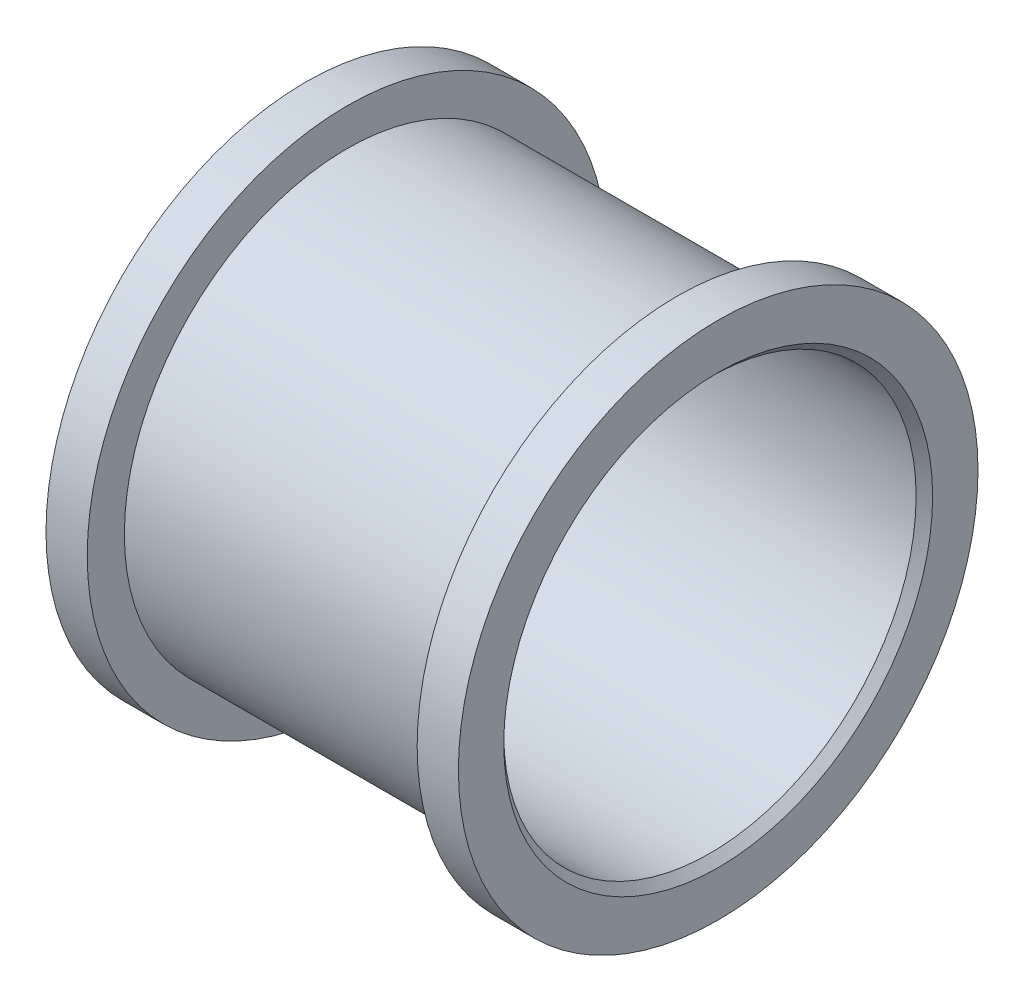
ISO-10303-21;
HEADER;
FILE_DESCRIPTION(('STEP AP214'),'2;1');
FILE_NAME('part.step','',(''),(''),'','','');
FILE_SCHEMA(('AUTOMOTIVE_DESIGN { 1 0 10303 214 1 1 1 1 }'));
ENDSEC;
DATA;
#1=APPLICATION_CONTEXT('core data for automotive mechanical design processes');
#2=APPLICATION_PROTOCOL_DEFINITION('international standard','automotive_design',2000,#1);
#3=PRODUCT_CONTEXT('',#1,'mechanical');
#4=PRODUCT('Part','Part','',(#3));
#5=PRODUCT_RELATED_PRODUCT_CATEGORY('part','',(#4));
#6=PRODUCT_DEFINITION_FORMATION('','',#4);
#7=PRODUCT_DEFINITION_CONTEXT('part definition',#1,'design');
#8=PRODUCT_DEFINITION('design','',#6,#7);
#9=PRODUCT_DEFINITION_SHAPE('','',#8);
#10=(LENGTH_UNIT() NAMED_UNIT(*) SI_UNIT(.MILLI.,.METRE.));
#11=(NAMED_UNIT(*) PLANE_ANGLE_UNIT() SI_UNIT($,.RADIAN.));
#12=(NAMED_UNIT(*) SI_UNIT($,.STERADIAN.) SOLID_ANGLE_UNIT());
#13=UNCERTAINTY_MEASURE_WITH_UNIT(LENGTH_MEASURE(1.E-05),#10,'distance_accuracy_value','');
#14=(GEOMETRIC_REPRESENTATION_CONTEXT(3) GLOBAL_UNCERTAINTY_ASSIGNED_CONTEXT((#13)) GLOBAL_UNIT_ASSIGNED_CONTEXT((#10,
#11,#12)) REPRESENTATION_CONTEXT('',''));
#15=CARTESIAN_POINT('',(0.,0.,0.));
#16=DIRECTION('',(0.,0.,1.));
#17=DIRECTION('',(1.,0.,0.));
#18=AXIS2_PLACEMENT_3D('',#15,#16,#17);
#19=CARTESIAN_POINT('',(0.,2.5,0.));
#20=DIRECTION('',(1.,0.,0.));
#21=DIRECTION('',(0.,0.,-1.));
#22=AXIS2_PLACEMENT_3D('',#19,#20,#21);
#23=PLANE('',#22);
#24=CARTESIAN_POINT('',(0.,0.,0.));
#25=DIRECTION('',(1.,0.,0.));
#26=DIRECTION('',(0.,0.,-1.));
#27=AXIS2_PLACEMENT_3D('',#24,#25,#26);
#28=CIRCLE('',#27,2.6);
#29=CARTESIAN_POINT('',(0.,0.,-2.6));
#30=VERTEX_POINT('',#29);
#31=EDGE_CURVE('E356',#30,#30,#28,.T.);
#32=ORIENTED_EDGE('',*,*,#31,.T.);
#33=EDGE_LOOP('',(#32));
#34=FACE_BOUND('',#33,.T.);
#35=CARTESIAN_POINT('',(0.,0.,0.));
#36=DIRECTION('',(-1.,0.,0.));
#37=DIRECTION('',(0.,0.,1.));
#38=AXIS2_PLACEMENT_3D('',#35,#36,#37);
#39=CIRCLE('',#38,3.15);
#40=CARTESIAN_POINT('',(0.,0.,3.15));
#41=VERTEX_POINT('',#40);
#42=EDGE_CURVE('E369',#41,#41,#39,.T.);
#43=ORIENTED_EDGE('',*,*,#42,.T.);
#44=EDGE_LOOP('',(#43));
#45=FACE_BOUND('',#44,.T.);
#46=ADVANCED_FACE('F350',(#34,#45),#23,.F.);
#47=CARTESIAN_POINT('',(-47.6496124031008,0.,0.));
#48=DIRECTION('',(-1.,0.,0.));
#49=DIRECTION('',(0.,0.,1.));
#50=AXIS2_PLACEMENT_3D('',#47,#48,#49);
#51=CYLINDRICAL_SURFACE('',#50,3.15);
#52=ORIENTED_EDGE('',*,*,#42,.F.);
#53=EDGE_LOOP('',(#52));
#54=FACE_BOUND('',#53,.T.);
#55=CARTESIAN_POINT('',(0.5,0.,0.));
#56=DIRECTION('',(-1.,0.,0.));
#57=DIRECTION('',(0.,0.,1.));
#58=AXIS2_PLACEMENT_3D('',#55,#56,#57);
#59=CIRCLE('',#58,3.15);
#60=CARTESIAN_POINT('',(0.5,0.,3.15));
#61=VERTEX_POINT('',#60);
#62=EDGE_CURVE('E372',#61,#61,#59,.T.);
#63=ORIENTED_EDGE('',*,*,#62,.T.);
#64=EDGE_LOOP('',(#63));
#65=FACE_BOUND('',#64,.T.);
#66=ADVANCED_FACE('F405',(#54,#65),#51,.T.);
#67=CARTESIAN_POINT('',(0.5,3.15,0.));
#68=DIRECTION('',(-1.,0.,0.));
#69=DIRECTION('',(0.,0.,1.));
#70=AXIS2_PLACEMENT_3D('',#67,#68,#69);
#71=PLANE('',#70);
#72=ORIENTED_EDGE('',*,*,#62,.F.);
#73=EDGE_LOOP('',(#72));
#74=FACE_BOUND('',#73,.T.);
#75=CARTESIAN_POINT('',(0.5,0.,0.));
#76=DIRECTION('',(-1.,0.,0.));
#77=DIRECTION('',(0.,0.,1.));
#78=AXIS2_PLACEMENT_3D('',#75,#76,#77);
#79=CIRCLE('',#78,2.7);
#80=CARTESIAN_POINT('',(0.5,0.,2.7));
#81=VERTEX_POINT('',#80);
#82=EDGE_CURVE('E375',#81,#81,#79,.T.);
#83=ORIENTED_EDGE('',*,*,#82,.T.);
#84=EDGE_LOOP('',(#83));
#85=FACE_BOUND('',#84,.T.);
#86=ADVANCED_FACE('F409',(#74,#85),#71,.F.);
#87=CARTESIAN_POINT('',(-47.6496124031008,0.,0.));
#88=DIRECTION('',(-1.,0.,0.));
#89=DIRECTION('',(0.,0.,1.));
#90=AXIS2_PLACEMENT_3D('',#87,#88,#89);
#91=CYLINDRICAL_SURFACE('',#90,2.7);
#92=ORIENTED_EDGE('',*,*,#82,.F.);
#93=EDGE_LOOP('',(#92));
#94=FACE_BOUND('',#93,.T.);
#95=CARTESIAN_POINT('',(4.5,0.,0.));
#96=DIRECTION('',(-1.,0.,0.));
#97=DIRECTION('',(0.,0.,1.));
#98=AXIS2_PLACEMENT_3D('',#95,#96,#97);
#99=CIRCLE('',#98,2.7);
#100=CARTESIAN_POINT('',(4.5,0.,2.7));
#101=VERTEX_POINT('',#100);
#102=EDGE_CURVE('E378',#101,#101,#99,.T.);
#103=ORIENTED_EDGE('',*,*,#102,.T.);
#104=EDGE_LOOP('',(#103));
#105=FACE_BOUND('',#104,.T.);
#106=ADVANCED_FACE('F418',(#94,#105),#91,.T.);
#107=CARTESIAN_POINT('',(4.5,2.7,0.));
#108=DIRECTION('',(1.,0.,0.));
#109=DIRECTION('',(0.,0.,-1.));
#110=AXIS2_PLACEMENT_3D('',#107,#108,#109);
#111=PLANE('',#110);
#112=ORIENTED_EDGE('',*,*,#102,.F.);
#113=EDGE_LOOP('',(#112));
#114=FACE_BOUND('',#113,.T.);
#115=CARTESIAN_POINT('',(4.5,0.,0.));
#116=DIRECTION('',(-1.,0.,0.));
#117=DIRECTION('',(0.,0.,1.));
#118=AXIS2_PLACEMENT_3D('',#115,#116,#117);
#119=CIRCLE('',#118,3.15);
#120=CARTESIAN_POINT('',(4.5,0.,3.15));
#121=VERTEX_POINT('',#120);
#122=EDGE_CURVE('E381',#121,#121,#119,.T.);
#123=ORIENTED_EDGE('',*,*,#122,.T.);
#124=EDGE_LOOP('',(#123));
#125=FACE_BOUND('',#124,.T.);
#126=ADVANCED_FACE('F402',(#114,#125),#111,.F.);
#127=CARTESIAN_POINT('',(-47.6496124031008,0.,0.));
#128=DIRECTION('',(-1.,0.,0.));
#129=DIRECTION('',(0.,0.,1.));
#130=AXIS2_PLACEMENT_3D('',#127,#128,#129);
#131=CYLINDRICAL_SURFACE('',#130,3.15);
#132=ORIENTED_EDGE('',*,*,#122,.F.);
#133=EDGE_LOOP('',(#132));
#134=FACE_BOUND('',#133,.T.);
#135=CARTESIAN_POINT('',(5.,0.,0.));
#136=DIRECTION('',(-1.,0.,0.));
#137=DIRECTION('',(0.,0.,1.));
#138=AXIS2_PLACEMENT_3D('',#135,#136,#137);
#139=CIRCLE('',#138,3.15);
#140=CARTESIAN_POINT('',(5.,0.,3.15));
#141=VERTEX_POINT('',#140);
#142=EDGE_CURVE('E384',#141,#141,#139,.T.);
#143=ORIENTED_EDGE('',*,*,#142,.T.);
#144=EDGE_LOOP('',(#143));
#145=FACE_BOUND('',#144,.T.);
#146=ADVANCED_FACE('F388',(#134,#145),#131,.T.);
#147=CARTESIAN_POINT('',(5.,2.5,0.));
#148=DIRECTION('',(-1.,0.,0.));
#149=DIRECTION('',(0.,0.,1.));
#150=AXIS2_PLACEMENT_3D('',#147,#148,#149);
#151=PLANE('',#150);
#152=CARTESIAN_POINT('',(5.,0.,0.));
#153=DIRECTION('',(-1.,0.,0.));
#154=DIRECTION('',(0.,0.,1.));
#155=AXIS2_PLACEMENT_3D('',#152,#153,#154);
#156=CIRCLE('',#155,2.6);
#157=CARTESIAN_POINT('',(5.,0.,2.6));
#158=VERTEX_POINT('',#157);
#159=EDGE_CURVE('E10',#158,#158,#156,.T.);
#160=ORIENTED_EDGE('',*,*,#159,.T.);
#161=EDGE_LOOP('',(#160));
#162=FACE_BOUND('',#161,.T.);
#163=ORIENTED_EDGE('',*,*,#142,.F.);
#164=EDGE_LOOP('',(#163));
#165=FACE_BOUND('',#164,.T.);
#166=ADVANCED_FACE('F390',(#162,#165),#151,.F.);
#167=CARTESIAN_POINT('',(-47.6496124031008,0.,0.));
#168=DIRECTION('',(-1.,0.,0.));
#169=DIRECTION('',(0.,0.,1.));
#170=AXIS2_PLACEMENT_3D('',#167,#168,#169);
#171=CYLINDRICAL_SURFACE('',#170,2.5);
#172=CARTESIAN_POINT('',(0.100000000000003,0.,0.));
#173=DIRECTION('',(1.,0.,0.));
#174=DIRECTION('',(0.,0.,-1.));
#175=AXIS2_PLACEMENT_3D('',#172,#173,#174);
#176=CIRCLE('',#175,2.5);
#177=CARTESIAN_POINT('',(0.100000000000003,0.,-2.5));
#178=VERTEX_POINT('',#177);
#179=EDGE_CURVE('E360',#178,#178,#176,.F.);
#180=ORIENTED_EDGE('',*,*,#179,.T.);
#181=EDGE_LOOP('',(#180));
#182=FACE_BOUND('',#181,.T.);
#183=CARTESIAN_POINT('',(4.9,0.,0.));
#184=DIRECTION('',(-1.,0.,0.));
#185=DIRECTION('',(0.,0.,1.));
#186=AXIS2_PLACEMENT_3D('',#183,#184,#185);
#187=CIRCLE('',#186,2.5);
#188=CARTESIAN_POINT('',(4.9,0.,2.5));
#189=VERTEX_POINT('',#188);
#190=EDGE_CURVE('E364',#189,#189,#187,.F.);
#191=ORIENTED_EDGE('',*,*,#190,.T.);
#192=EDGE_LOOP('',(#191));
#193=FACE_BOUND('',#192,.T.);
#194=ADVANCED_FACE('F392',(#182,#193),#171,.F.);
#195=CARTESIAN_POINT('',(0.100000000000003,0.,0.));
#196=DIRECTION('',(-1.,0.,0.));
#197=DIRECTION('',(0.,0.,1.));
#198=AXIS2_PLACEMENT_3D('',#195,#196,#197);
#199=CONICAL_SURFACE('',#198,2.5,0.785398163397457);
#200=ORIENTED_EDGE('',*,*,#31,.F.);
#201=EDGE_LOOP('',(#200));
#202=FACE_BOUND('',#201,.T.);
#203=ORIENTED_EDGE('',*,*,#179,.F.);
#204=EDGE_LOOP('',(#203));
#205=FACE_BOUND('',#204,.T.);
#206=ADVANCED_FACE('F398',(#202,#205),#199,.F.);
#207=CARTESIAN_POINT('',(5.,0.,0.));
#208=DIRECTION('',(1.,0.,0.));
#209=DIRECTION('',(0.,0.,-1.));
#210=AXIS2_PLACEMENT_3D('',#207,#208,#209);
#211=CONICAL_SURFACE('',#210,2.6,0.78539816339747);
#212=ORIENTED_EDGE('',*,*,#190,.F.);
#213=EDGE_LOOP('',(#212));
#214=FACE_BOUND('',#213,.T.);
#215=ORIENTED_EDGE('',*,*,#159,.F.);
#216=EDGE_LOOP('',(#215));
#217=FACE_BOUND('',#216,.T.);
#218=ADVANCED_FACE('F452',(#214,#217),#211,.F.);
#219=CLOSED_SHELL('',(#46,#66,#86,#106,#126,#146,#166,#194,#206,#218));
#220=MANIFOLD_SOLID_BREP('B2',#219);
#221=ADVANCED_BREP_SHAPE_REPRESENTATION('',(#18,#220),#14);
#222=SHAPE_DEFINITION_REPRESENTATION(#9,#221);
ENDSEC;
END-ISO-10303-21;
